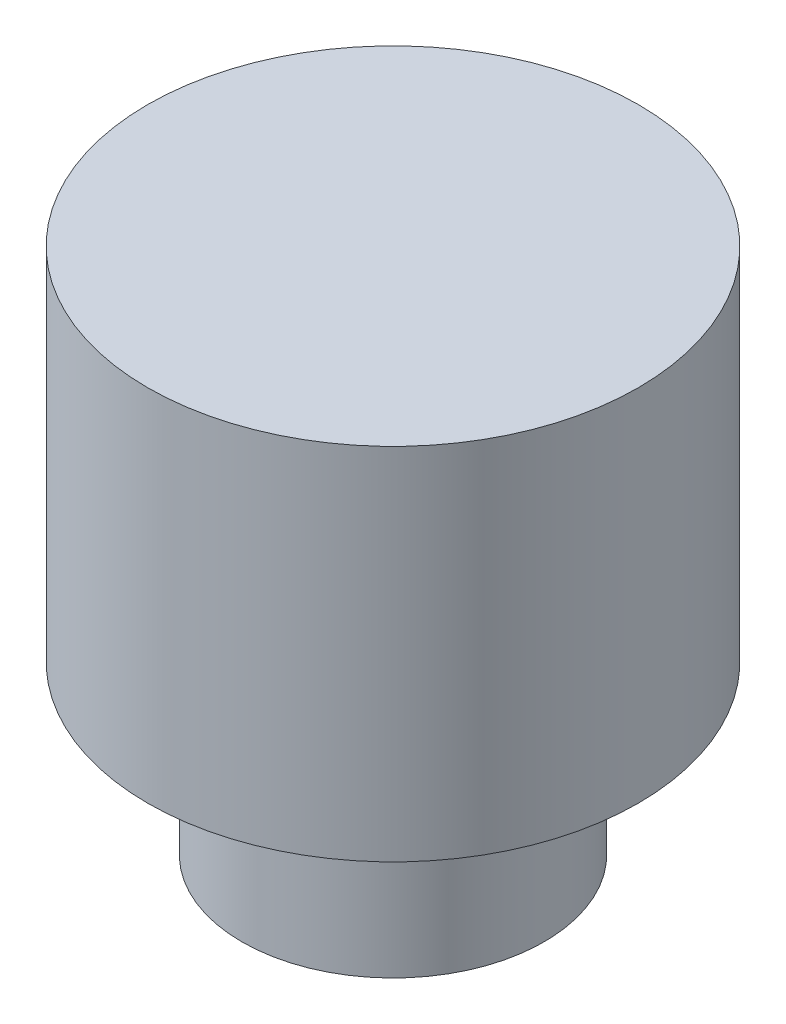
from build123d import *

# Parameters (mm, degrees)
ESQUISSE1_R      = 10.5
EXTRUSION1_DEPTH = 11.61
ESQUISSE3_R      = 17.04
EXTRUSION2_DEPTH = 25


with BuildPart() as part:
    # Esquisse1 → Extrusion1 (new body)
    with BuildSketch(Plane(origin=(0, 0, 0), x_dir=(1, 0, 0), z_dir=(0, 1, 0))):
        with Locations(Location((0, 0, 0), (0, 0, 270))):
            Circle(ESQUISSE1_R)
    extrude(amount=EXTRUSION1_DEPTH)

    # Esquisse3 → Extrusion2 (add)
    with BuildSketch(Plane(origin=(0, 11.61, 0), x_dir=(1, 0, 0), z_dir=(0, 1, 0))):
        with Locations(Location((0, 0, 0), (0, 0, 270))):
            Circle(ESQUISSE3_R)
    extrude(amount=EXTRUSION2_DEPTH)


solid = part.part
